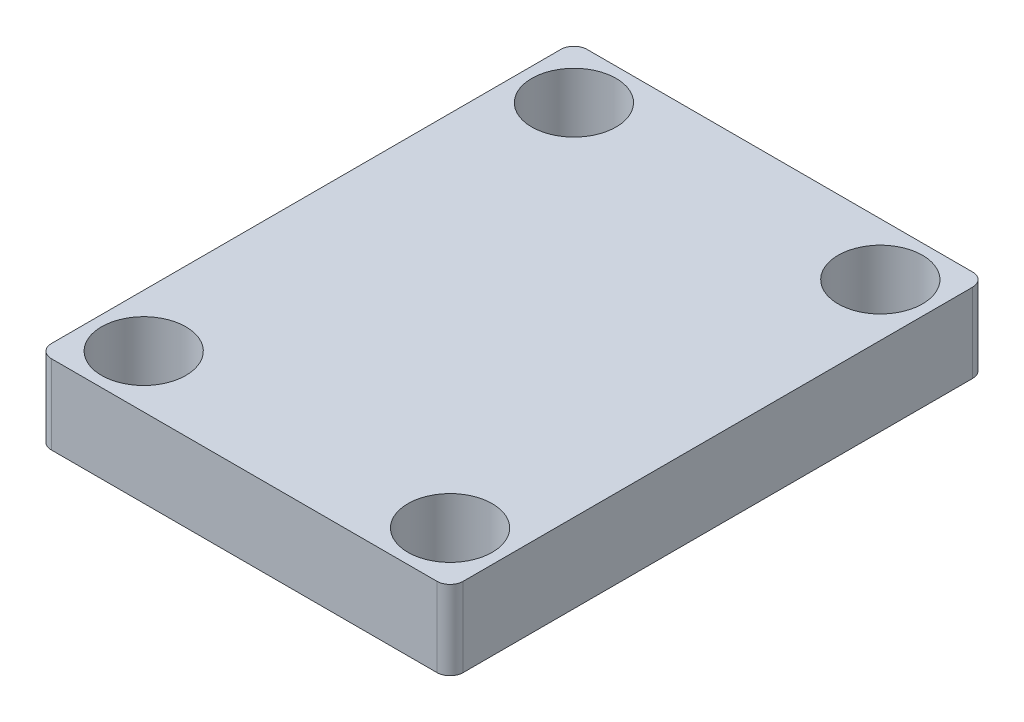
ISO-10303-21;
HEADER;
FILE_DESCRIPTION(('STEP AP214'),'2;1');
FILE_NAME('part.step','',(''),(''),'','','');
FILE_SCHEMA(('AUTOMOTIVE_DESIGN { 1 0 10303 214 1 1 1 1 }'));
ENDSEC;
DATA;
#1=APPLICATION_CONTEXT('core data for automotive mechanical design processes');
#2=APPLICATION_PROTOCOL_DEFINITION('international standard','automotive_design',2000,#1);
#3=PRODUCT_CONTEXT('',#1,'mechanical');
#4=PRODUCT('Part','Part','',(#3));
#5=PRODUCT_RELATED_PRODUCT_CATEGORY('part','',(#4));
#6=PRODUCT_DEFINITION_FORMATION('','',#4);
#7=PRODUCT_DEFINITION_CONTEXT('part definition',#1,'design');
#8=PRODUCT_DEFINITION('design','',#6,#7);
#9=PRODUCT_DEFINITION_SHAPE('','',#8);
#10=(LENGTH_UNIT() NAMED_UNIT(*) SI_UNIT(.MILLI.,.METRE.));
#11=(NAMED_UNIT(*) PLANE_ANGLE_UNIT() SI_UNIT($,.RADIAN.));
#12=(NAMED_UNIT(*) SI_UNIT($,.STERADIAN.) SOLID_ANGLE_UNIT());
#13=UNCERTAINTY_MEASURE_WITH_UNIT(LENGTH_MEASURE(1.E-05),#10,'distance_accuracy_value','');
#14=(GEOMETRIC_REPRESENTATION_CONTEXT(3) GLOBAL_UNCERTAINTY_ASSIGNED_CONTEXT((#13)) GLOBAL_UNIT_ASSIGNED_CONTEXT((#10,
#11,#12)) REPRESENTATION_CONTEXT('',''));
#15=CARTESIAN_POINT('',(0.,0.,0.));
#16=DIRECTION('',(0.,0.,1.));
#17=DIRECTION('',(1.,0.,0.));
#18=AXIS2_PLACEMENT_3D('',#15,#16,#17);
#19=CARTESIAN_POINT('',(0.,3.,0.));
#20=DIRECTION('',(0.,-1.,0.));
#21=DIRECTION('',(0.,0.,-1.));
#22=AXIS2_PLACEMENT_3D('',#19,#20,#21);
#23=PLANE('',#22);
#24=DIRECTION('',(0.,0.,1.));
#25=VECTOR('',#24,1.);
#26=CARTESIAN_POINT('',(-7.8105,3.,10.16));
#27=LINE('',#26,#25);
#28=CARTESIAN_POINT('',(-7.8105,3.,-9.66));
#29=VERTEX_POINT('',#28);
#30=CARTESIAN_POINT('',(-7.8105,3.,9.66));
#31=VERTEX_POINT('',#30);
#32=EDGE_CURVE('E183',#29,#31,#27,.T.);
#33=ORIENTED_EDGE('',*,*,#32,.T.);
#34=CARTESIAN_POINT('',(-7.3105,3.,9.66));
#35=DIRECTION('',(0.,-1.,0.));
#36=DIRECTION('',(0.,0.,-1.));
#37=AXIS2_PLACEMENT_3D('',#34,#35,#36);
#38=CIRCLE('',#37,0.5);
#39=CARTESIAN_POINT('',(-7.3105,3.,10.16));
#40=VERTEX_POINT('',#39);
#41=EDGE_CURVE('E160',#31,#40,#38,.F.);
#42=ORIENTED_EDGE('',*,*,#41,.T.);
#43=DIRECTION('',(1.,0.,0.));
#44=VECTOR('',#43,1.);
#45=CARTESIAN_POINT('',(-7.8105,3.,10.16));
#46=LINE('',#45,#44);
#47=CARTESIAN_POINT('',(7.3105,3.,10.16));
#48=VERTEX_POINT('',#47);
#49=EDGE_CURVE('E131',#40,#48,#46,.T.);
#50=ORIENTED_EDGE('',*,*,#49,.T.);
#51=CARTESIAN_POINT('',(7.3105,3.,9.66));
#52=DIRECTION('',(0.,-1.,0.));
#53=DIRECTION('',(0.,0.,-1.));
#54=AXIS2_PLACEMENT_3D('',#51,#52,#53);
#55=CIRCLE('',#54,0.5);
#56=CARTESIAN_POINT('',(7.8105,3.,9.66));
#57=VERTEX_POINT('',#56);
#58=EDGE_CURVE('E155',#48,#57,#55,.F.);
#59=ORIENTED_EDGE('',*,*,#58,.T.);
#60=DIRECTION('',(0.,0.,-1.));
#61=VECTOR('',#60,1.);
#62=CARTESIAN_POINT('',(7.8105,3.,10.16));
#63=LINE('',#62,#61);
#64=CARTESIAN_POINT('',(7.8105,3.,-9.66));
#65=VERTEX_POINT('',#64);
#66=EDGE_CURVE('E138',#57,#65,#63,.T.);
#67=ORIENTED_EDGE('',*,*,#66,.T.);
#68=CARTESIAN_POINT('',(7.3105,3.,-9.66));
#69=DIRECTION('',(0.,-1.,0.));
#70=DIRECTION('',(0.,0.,-1.));
#71=AXIS2_PLACEMENT_3D('',#68,#69,#70);
#72=CIRCLE('',#71,0.5);
#73=CARTESIAN_POINT('',(7.3105,3.,-10.16));
#74=VERTEX_POINT('',#73);
#75=EDGE_CURVE('E67',#65,#74,#72,.F.);
#76=ORIENTED_EDGE('',*,*,#75,.T.);
#77=DIRECTION('',(-1.,0.,0.));
#78=VECTOR('',#77,1.);
#79=CARTESIAN_POINT('',(-7.8105,3.,-10.16));
#80=LINE('',#79,#78);
#81=CARTESIAN_POINT('',(-7.3105,3.,-10.16));
#82=VERTEX_POINT('',#81);
#83=EDGE_CURVE('E141',#74,#82,#80,.T.);
#84=ORIENTED_EDGE('',*,*,#83,.T.);
#85=CARTESIAN_POINT('',(-7.3105,3.,-9.66));
#86=DIRECTION('',(0.,-1.,0.));
#87=DIRECTION('',(0.,0.,-1.));
#88=AXIS2_PLACEMENT_3D('',#85,#86,#87);
#89=CIRCLE('',#88,0.5);
#90=EDGE_CURVE('E158',#82,#29,#89,.F.);
#91=ORIENTED_EDGE('',*,*,#90,.T.);
#92=EDGE_LOOP('',(#33,#42,#50,#59,#67,#76,#84,#91));
#93=FACE_BOUND('',#92,.T.);
#94=CARTESIAN_POINT('',(5.8105,3.,8.16));
#95=DIRECTION('',(0.,1.,0.));
#96=DIRECTION('',(0.,0.,1.));
#97=AXIS2_PLACEMENT_3D('',#94,#95,#96);
#98=CIRCLE('',#97,1.6);
#99=CARTESIAN_POINT('',(5.8105,3.,9.76));
#100=VERTEX_POINT('',#99);
#101=EDGE_CURVE('E176',#100,#100,#98,.T.);
#102=ORIENTED_EDGE('',*,*,#101,.F.);
#103=EDGE_LOOP('',(#102));
#104=FACE_BOUND('',#103,.T.);
#105=CARTESIAN_POINT('',(-5.8105,3.,8.16));
#106=DIRECTION('',(0.,1.,0.));
#107=DIRECTION('',(0.,0.,-1.));
#108=AXIS2_PLACEMENT_3D('',#105,#106,#107);
#109=CIRCLE('',#108,1.6);
#110=CARTESIAN_POINT('',(-5.8105,3.,6.56));
#111=VERTEX_POINT('',#110);
#112=EDGE_CURVE('E188',#111,#111,#109,.T.);
#113=ORIENTED_EDGE('',*,*,#112,.F.);
#114=EDGE_LOOP('',(#113));
#115=FACE_BOUND('',#114,.T.);
#116=CARTESIAN_POINT('',(5.8105,3.,-8.16));
#117=DIRECTION('',(0.,1.,0.));
#118=DIRECTION('',(0.,0.,-1.));
#119=AXIS2_PLACEMENT_3D('',#116,#117,#118);
#120=CIRCLE('',#119,1.6);
#121=CARTESIAN_POINT('',(5.8105,3.,-9.76));
#122=VERTEX_POINT('',#121);
#123=EDGE_CURVE('E193',#122,#122,#120,.T.);
#124=ORIENTED_EDGE('',*,*,#123,.F.);
#125=EDGE_LOOP('',(#124));
#126=FACE_BOUND('',#125,.T.);
#127=CARTESIAN_POINT('',(-5.8105,3.,-8.16));
#128=DIRECTION('',(0.,1.,0.));
#129=DIRECTION('',(0.,0.,1.));
#130=AXIS2_PLACEMENT_3D('',#127,#128,#129);
#131=CIRCLE('',#130,1.6);
#132=CARTESIAN_POINT('',(-5.8105,3.,-6.56));
#133=VERTEX_POINT('',#132);
#134=EDGE_CURVE('E199',#133,#133,#131,.T.);
#135=ORIENTED_EDGE('',*,*,#134,.F.);
#136=EDGE_LOOP('',(#135));
#137=FACE_BOUND('',#136,.T.);
#138=ADVANCED_FACE('F45',(#93,#104,#115,#126,#137),#23,.F.);
#139=CARTESIAN_POINT('',(0.,0.,0.));
#140=DIRECTION('',(0.,-1.,0.));
#141=DIRECTION('',(0.,0.,-1.));
#142=AXIS2_PLACEMENT_3D('',#139,#140,#141);
#143=PLANE('',#142);
#144=CARTESIAN_POINT('',(5.8105,0.,-8.16));
#145=DIRECTION('',(0.,1.,0.));
#146=DIRECTION('',(0.,0.,-1.));
#147=AXIS2_PLACEMENT_3D('',#144,#145,#146);
#148=CIRCLE('',#147,1.6);
#149=CARTESIAN_POINT('',(5.8105,0.,-9.76));
#150=VERTEX_POINT('',#149);
#151=EDGE_CURVE('E196',#150,#150,#148,.T.);
#152=ORIENTED_EDGE('',*,*,#151,.T.);
#153=EDGE_LOOP('',(#152));
#154=FACE_BOUND('',#153,.T.);
#155=CARTESIAN_POINT('',(5.8105,0.,8.16));
#156=DIRECTION('',(0.,1.,0.));
#157=DIRECTION('',(0.,0.,1.));
#158=AXIS2_PLACEMENT_3D('',#155,#156,#157);
#159=CIRCLE('',#158,1.6);
#160=CARTESIAN_POINT('',(5.8105,0.,9.76));
#161=VERTEX_POINT('',#160);
#162=EDGE_CURVE('E179',#161,#161,#159,.T.);
#163=ORIENTED_EDGE('',*,*,#162,.T.);
#164=EDGE_LOOP('',(#163));
#165=FACE_BOUND('',#164,.T.);
#166=DIRECTION('',(1.,0.,0.));
#167=VECTOR('',#166,1.);
#168=CARTESIAN_POINT('',(-7.8105,0.,10.16));
#169=LINE('',#168,#167);
#170=CARTESIAN_POINT('',(-7.3105,0.,10.16));
#171=VERTEX_POINT('',#170);
#172=CARTESIAN_POINT('',(7.3105,0.,10.16));
#173=VERTEX_POINT('',#172);
#174=EDGE_CURVE('E128',#171,#173,#169,.T.);
#175=ORIENTED_EDGE('',*,*,#174,.F.);
#176=CARTESIAN_POINT('',(-7.3105,0.,9.66));
#177=DIRECTION('',(0.,-1.,0.));
#178=DIRECTION('',(0.,0.,-1.));
#179=AXIS2_PLACEMENT_3D('',#176,#177,#178);
#180=CIRCLE('',#179,0.5);
#181=CARTESIAN_POINT('',(-7.8105,0.,9.66));
#182=VERTEX_POINT('',#181);
#183=EDGE_CURVE('E111',#171,#182,#180,.T.);
#184=ORIENTED_EDGE('',*,*,#183,.T.);
#185=DIRECTION('',(0.,0.,1.));
#186=VECTOR('',#185,1.);
#187=CARTESIAN_POINT('',(-7.8105,0.,10.16));
#188=LINE('',#187,#186);
#189=CARTESIAN_POINT('',(-7.8105,0.,-9.66));
#190=VERTEX_POINT('',#189);
#191=EDGE_CURVE('E139',#190,#182,#188,.T.);
#192=ORIENTED_EDGE('',*,*,#191,.F.);
#193=CARTESIAN_POINT('',(-7.3105,0.,-9.66));
#194=DIRECTION('',(0.,-1.,0.));
#195=DIRECTION('',(0.,0.,-1.));
#196=AXIS2_PLACEMENT_3D('',#193,#194,#195);
#197=CIRCLE('',#196,0.5);
#198=CARTESIAN_POINT('',(-7.3105,0.,-10.16));
#199=VERTEX_POINT('',#198);
#200=EDGE_CURVE('E122',#190,#199,#197,.T.);
#201=ORIENTED_EDGE('',*,*,#200,.T.);
#202=DIRECTION('',(-1.,0.,0.));
#203=VECTOR('',#202,1.);
#204=CARTESIAN_POINT('',(-7.8105,0.,-10.16));
#205=LINE('',#204,#203);
#206=CARTESIAN_POINT('',(7.3105,0.,-10.16));
#207=VERTEX_POINT('',#206);
#208=EDGE_CURVE('E143',#207,#199,#205,.T.);
#209=ORIENTED_EDGE('',*,*,#208,.F.);
#210=CARTESIAN_POINT('',(7.3105,0.,-9.66));
#211=DIRECTION('',(0.,-1.,0.));
#212=DIRECTION('',(0.,0.,-1.));
#213=AXIS2_PLACEMENT_3D('',#210,#211,#212);
#214=CIRCLE('',#213,0.5);
#215=CARTESIAN_POINT('',(7.8105,0.,-9.66));
#216=VERTEX_POINT('',#215);
#217=EDGE_CURVE('E149',#207,#216,#214,.T.);
#218=ORIENTED_EDGE('',*,*,#217,.T.);
#219=DIRECTION('',(0.,0.,-1.));
#220=VECTOR('',#219,1.);
#221=CARTESIAN_POINT('',(7.8105,0.,10.16));
#222=LINE('',#221,#220);
#223=CARTESIAN_POINT('',(7.8105,0.,9.66));
#224=VERTEX_POINT('',#223);
#225=EDGE_CURVE('E171',#224,#216,#222,.T.);
#226=ORIENTED_EDGE('',*,*,#225,.F.);
#227=CARTESIAN_POINT('',(7.3105,0.,9.66));
#228=DIRECTION('',(0.,-1.,0.));
#229=DIRECTION('',(0.,0.,-1.));
#230=AXIS2_PLACEMENT_3D('',#227,#228,#229);
#231=CIRCLE('',#230,0.5);
#232=EDGE_CURVE('E132',#224,#173,#231,.T.);
#233=ORIENTED_EDGE('',*,*,#232,.T.);
#234=EDGE_LOOP('',(#175,#184,#192,#201,#209,#218,#226,#233));
#235=FACE_BOUND('',#234,.T.);
#236=CARTESIAN_POINT('',(-5.8105,0.,8.16));
#237=DIRECTION('',(0.,1.,0.));
#238=DIRECTION('',(0.,0.,-1.));
#239=AXIS2_PLACEMENT_3D('',#236,#237,#238);
#240=CIRCLE('',#239,1.6);
#241=CARTESIAN_POINT('',(-5.8105,0.,6.56));
#242=VERTEX_POINT('',#241);
#243=EDGE_CURVE('E190',#242,#242,#240,.T.);
#244=ORIENTED_EDGE('',*,*,#243,.T.);
#245=EDGE_LOOP('',(#244));
#246=FACE_BOUND('',#245,.T.);
#247=CARTESIAN_POINT('',(-5.8105,0.,-8.16));
#248=DIRECTION('',(0.,1.,0.));
#249=DIRECTION('',(0.,0.,1.));
#250=AXIS2_PLACEMENT_3D('',#247,#248,#249);
#251=CIRCLE('',#250,1.6);
#252=CARTESIAN_POINT('',(-5.8105,0.,-6.56));
#253=VERTEX_POINT('',#252);
#254=EDGE_CURVE('E202',#253,#253,#251,.T.);
#255=ORIENTED_EDGE('',*,*,#254,.T.);
#256=EDGE_LOOP('',(#255));
#257=FACE_BOUND('',#256,.T.);
#258=ADVANCED_FACE('F135',(#154,#165,#235,#246,#257),#143,.T.);
#259=CARTESIAN_POINT('',(7.8105,3.,10.16));
#260=DIRECTION('',(-1.,0.,0.));
#261=DIRECTION('',(0.,0.,1.));
#262=AXIS2_PLACEMENT_3D('',#259,#260,#261);
#263=PLANE('',#262);
#264=ORIENTED_EDGE('',*,*,#225,.T.);
#265=DIRECTION('',(0.,-1.,0.));
#266=VECTOR('',#265,1.);
#267=CARTESIAN_POINT('',(7.8105,3.,-9.66));
#268=LINE('',#267,#266);
#269=EDGE_CURVE('E11',#216,#65,#268,.F.);
#270=ORIENTED_EDGE('',*,*,#269,.T.);
#271=ORIENTED_EDGE('',*,*,#66,.F.);
#272=DIRECTION('',(0.,-1.,0.));
#273=VECTOR('',#272,1.);
#274=CARTESIAN_POINT('',(7.8105,3.,9.66));
#275=LINE('',#274,#273);
#276=EDGE_CURVE('E53',#57,#224,#275,.T.);
#277=ORIENTED_EDGE('',*,*,#276,.T.);
#278=EDGE_LOOP('',(#264,#270,#271,#277));
#279=FACE_BOUND('',#278,.T.);
#280=ADVANCED_FACE('F170',(#279),#263,.F.);
#281=CARTESIAN_POINT('',(-7.8105,3.,-10.16));
#282=DIRECTION('',(0.,0.,1.));
#283=DIRECTION('',(1.,0.,0.));
#284=AXIS2_PLACEMENT_3D('',#281,#282,#283);
#285=PLANE('',#284);
#286=ORIENTED_EDGE('',*,*,#208,.T.);
#287=DIRECTION('',(0.,-1.,0.));
#288=VECTOR('',#287,1.);
#289=CARTESIAN_POINT('',(-7.3105,3.,-10.16));
#290=LINE('',#289,#288);
#291=EDGE_CURVE('E60',#199,#82,#290,.F.);
#292=ORIENTED_EDGE('',*,*,#291,.T.);
#293=ORIENTED_EDGE('',*,*,#83,.F.);
#294=DIRECTION('',(0.,-1.,0.));
#295=VECTOR('',#294,1.);
#296=CARTESIAN_POINT('',(7.3105,3.,-10.16));
#297=LINE('',#296,#295);
#298=EDGE_CURVE('E162',#74,#207,#297,.T.);
#299=ORIENTED_EDGE('',*,*,#298,.T.);
#300=EDGE_LOOP('',(#286,#292,#293,#299));
#301=FACE_BOUND('',#300,.T.);
#302=ADVANCED_FACE('F229',(#301),#285,.F.);
#303=CARTESIAN_POINT('',(-7.8105,3.,10.16));
#304=DIRECTION('',(1.,0.,0.));
#305=DIRECTION('',(0.,0.,-1.));
#306=AXIS2_PLACEMENT_3D('',#303,#304,#305);
#307=PLANE('',#306);
#308=ORIENTED_EDGE('',*,*,#191,.T.);
#309=DIRECTION('',(0.,-1.,0.));
#310=VECTOR('',#309,1.);
#311=CARTESIAN_POINT('',(-7.8105,3.,9.66));
#312=LINE('',#311,#310);
#313=EDGE_CURVE('E116',#182,#31,#312,.F.);
#314=ORIENTED_EDGE('',*,*,#313,.T.);
#315=ORIENTED_EDGE('',*,*,#32,.F.);
#316=DIRECTION('',(0.,-1.,0.));
#317=VECTOR('',#316,1.);
#318=CARTESIAN_POINT('',(-7.8105,3.,-9.66));
#319=LINE('',#318,#317);
#320=EDGE_CURVE('E121',#29,#190,#319,.T.);
#321=ORIENTED_EDGE('',*,*,#320,.T.);
#322=EDGE_LOOP('',(#308,#314,#315,#321));
#323=FACE_BOUND('',#322,.T.);
#324=ADVANCED_FACE('F226',(#323),#307,.F.);
#325=CARTESIAN_POINT('',(-7.8105,3.,10.16));
#326=DIRECTION('',(0.,0.,-1.));
#327=DIRECTION('',(-1.,0.,0.));
#328=AXIS2_PLACEMENT_3D('',#325,#326,#327);
#329=PLANE('',#328);
#330=ORIENTED_EDGE('',*,*,#49,.F.);
#331=DIRECTION('',(0.,-1.,0.));
#332=VECTOR('',#331,1.);
#333=CARTESIAN_POINT('',(-7.3105,3.,10.16));
#334=LINE('',#333,#332);
#335=EDGE_CURVE('E115',#40,#171,#334,.T.);
#336=ORIENTED_EDGE('',*,*,#335,.T.);
#337=ORIENTED_EDGE('',*,*,#174,.T.);
#338=DIRECTION('',(0.,-1.,0.));
#339=VECTOR('',#338,1.);
#340=CARTESIAN_POINT('',(7.3105,3.,10.16));
#341=LINE('',#340,#339);
#342=EDGE_CURVE('E133',#173,#48,#341,.F.);
#343=ORIENTED_EDGE('',*,*,#342,.T.);
#344=EDGE_LOOP('',(#330,#336,#337,#343));
#345=FACE_BOUND('',#344,.T.);
#346=ADVANCED_FACE('F127',(#345),#329,.F.);
#347=CARTESIAN_POINT('',(5.8105,3.,8.16));
#348=DIRECTION('',(0.,-1.,0.));
#349=DIRECTION('',(0.,0.,-1.));
#350=AXIS2_PLACEMENT_3D('',#347,#348,#349);
#351=CYLINDRICAL_SURFACE('',#350,1.6);
#352=ORIENTED_EDGE('',*,*,#101,.T.);
#353=EDGE_LOOP('',(#352));
#354=FACE_BOUND('',#353,.T.);
#355=ORIENTED_EDGE('',*,*,#162,.F.);
#356=EDGE_LOOP('',(#355));
#357=FACE_BOUND('',#356,.T.);
#358=ADVANCED_FACE('F221',(#354,#357),#351,.F.);
#359=CARTESIAN_POINT('',(-5.8105,3.,8.16));
#360=DIRECTION('',(0.,-1.,0.));
#361=DIRECTION('',(0.,0.,-1.));
#362=AXIS2_PLACEMENT_3D('',#359,#360,#361);
#363=CYLINDRICAL_SURFACE('',#362,1.6);
#364=ORIENTED_EDGE('',*,*,#112,.T.);
#365=EDGE_LOOP('',(#364));
#366=FACE_BOUND('',#365,.T.);
#367=ORIENTED_EDGE('',*,*,#243,.F.);
#368=EDGE_LOOP('',(#367));
#369=FACE_BOUND('',#368,.T.);
#370=ADVANCED_FACE('F286',(#366,#369),#363,.F.);
#371=CARTESIAN_POINT('',(5.8105,3.,-8.16));
#372=DIRECTION('',(0.,-1.,0.));
#373=DIRECTION('',(0.,0.,-1.));
#374=AXIS2_PLACEMENT_3D('',#371,#372,#373);
#375=CYLINDRICAL_SURFACE('',#374,1.6);
#376=ORIENTED_EDGE('',*,*,#123,.T.);
#377=EDGE_LOOP('',(#376));
#378=FACE_BOUND('',#377,.T.);
#379=ORIENTED_EDGE('',*,*,#151,.F.);
#380=EDGE_LOOP('',(#379));
#381=FACE_BOUND('',#380,.T.);
#382=ADVANCED_FACE('F277',(#378,#381),#375,.F.);
#383=CARTESIAN_POINT('',(-5.8105,3.,-8.16));
#384=DIRECTION('',(0.,-1.,0.));
#385=DIRECTION('',(0.,0.,-1.));
#386=AXIS2_PLACEMENT_3D('',#383,#384,#385);
#387=CYLINDRICAL_SURFACE('',#386,1.6);
#388=ORIENTED_EDGE('',*,*,#134,.T.);
#389=EDGE_LOOP('',(#388));
#390=FACE_BOUND('',#389,.T.);
#391=ORIENTED_EDGE('',*,*,#254,.F.);
#392=EDGE_LOOP('',(#391));
#393=FACE_BOUND('',#392,.T.);
#394=ADVANCED_FACE('F208',(#390,#393),#387,.F.);
#395=CARTESIAN_POINT('',(-7.3105,3.,9.66));
#396=DIRECTION('',(0.,-1.,0.));
#397=DIRECTION('',(0.,0.,-1.));
#398=AXIS2_PLACEMENT_3D('',#395,#396,#397);
#399=CYLINDRICAL_SURFACE('',#398,0.5);
#400=ORIENTED_EDGE('',*,*,#41,.F.);
#401=ORIENTED_EDGE('',*,*,#313,.F.);
#402=ORIENTED_EDGE('',*,*,#183,.F.);
#403=ORIENTED_EDGE('',*,*,#335,.F.);
#404=EDGE_LOOP('',(#400,#401,#402,#403));
#405=FACE_BOUND('',#404,.T.);
#406=ADVANCED_FACE('F114',(#405),#399,.T.);
#407=CARTESIAN_POINT('',(-7.3105,3.,-9.66));
#408=DIRECTION('',(0.,-1.,0.));
#409=DIRECTION('',(0.,0.,-1.));
#410=AXIS2_PLACEMENT_3D('',#407,#408,#409);
#411=CYLINDRICAL_SURFACE('',#410,0.5);
#412=ORIENTED_EDGE('',*,*,#90,.F.);
#413=ORIENTED_EDGE('',*,*,#291,.F.);
#414=ORIENTED_EDGE('',*,*,#200,.F.);
#415=ORIENTED_EDGE('',*,*,#320,.F.);
#416=EDGE_LOOP('',(#412,#413,#414,#415));
#417=FACE_BOUND('',#416,.T.);
#418=ADVANCED_FACE('F237',(#417),#411,.T.);
#419=CARTESIAN_POINT('',(7.3105,3.,-9.66));
#420=DIRECTION('',(0.,-1.,0.));
#421=DIRECTION('',(0.,0.,-1.));
#422=AXIS2_PLACEMENT_3D('',#419,#420,#421);
#423=CYLINDRICAL_SURFACE('',#422,0.5);
#424=ORIENTED_EDGE('',*,*,#75,.F.);
#425=ORIENTED_EDGE('',*,*,#269,.F.);
#426=ORIENTED_EDGE('',*,*,#217,.F.);
#427=ORIENTED_EDGE('',*,*,#298,.F.);
#428=EDGE_LOOP('',(#424,#425,#426,#427));
#429=FACE_BOUND('',#428,.T.);
#430=ADVANCED_FACE('F239',(#429),#423,.T.);
#431=CARTESIAN_POINT('',(7.3105,3.,9.66));
#432=DIRECTION('',(0.,-1.,0.));
#433=DIRECTION('',(0.,0.,-1.));
#434=AXIS2_PLACEMENT_3D('',#431,#432,#433);
#435=CYLINDRICAL_SURFACE('',#434,0.5);
#436=ORIENTED_EDGE('',*,*,#58,.F.);
#437=ORIENTED_EDGE('',*,*,#342,.F.);
#438=ORIENTED_EDGE('',*,*,#232,.F.);
#439=ORIENTED_EDGE('',*,*,#276,.F.);
#440=EDGE_LOOP('',(#436,#437,#438,#439));
#441=FACE_BOUND('',#440,.T.);
#442=ADVANCED_FACE('F47',(#441),#435,.T.);
#443=CLOSED_SHELL('',(#138,#258,#280,#302,#324,#346,#358,#370,#382,#394,#406,#418,#430,#442));
#444=MANIFOLD_SOLID_BREP('B2',#443);
#445=ADVANCED_BREP_SHAPE_REPRESENTATION('',(#18,#444),#14);
#446=SHAPE_DEFINITION_REPRESENTATION(#9,#445);
ENDSEC;
END-ISO-10303-21;
